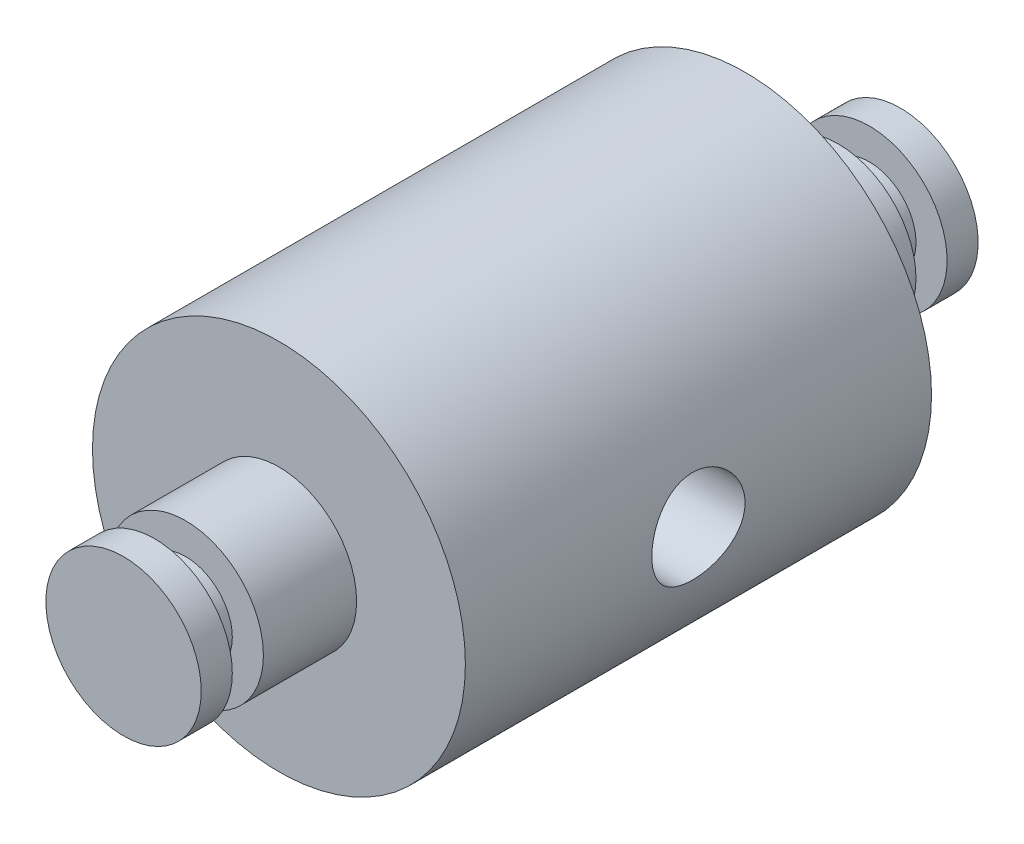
from build123d import *

# Parameters (mm, degrees)
ESQUISSE1_R             = 6
EXTRUSION1_DEPTH        = 15
ESQUISSE2_R             = 2.5
EXTRUSION2_DEPTH        = 3
ESQUISSE3_R             = 1.5
EXTRUSION3_DEPTH        = 1
ESQUISSE4_R             = 2.5
EXTRUSION4_DEPTH        = 1
EXTRUSION5_START        = 3
ESQUISSE5_R             = 2.5
EXTRUSION5_DEPTH        = 3
EXTRUSION6_START        = 1
ESQUISSE6_R             = 1.5
EXTRUSION6_DEPTH        = 1
EXTRUSION7_START        = 1
ESQUISSE7_R             = 2.5
EXTRUSION7_DEPTH        = 1
ESQUISSE8_R             = 4
ENL_V_MAT_EXTRU_1_DEPTH = 13
ESQUISSE9_R             = 1.5
ENL_V_MAT_EXTRU_2_DEPTH = 13


with BuildPart() as part:
    # Esquisse1 → Extrusion1 (new body)
    with BuildSketch(Plane.XY):
        Circle(ESQUISSE1_R)
    extrude(amount=-EXTRUSION1_DEPTH)

    # Esquisse2 → Extrusion2 (add)
    with BuildSketch(Plane.XY):
        Circle(ESQUISSE2_R)
    extrude(amount=EXTRUSION2_DEPTH)

    # Esquisse3 → Extrusion3 (add)
    with BuildSketch(Plane.XY.offset(3)):
        Circle(ESQUISSE3_R)
    extrude(amount=EXTRUSION3_DEPTH)

    # Esquisse4 → Extrusion4 (add)
    with BuildSketch(Plane.XY.offset(4)):
        Circle(ESQUISSE4_R)
    extrude(amount=EXTRUSION4_DEPTH)

    # Esquisse5 → Extrusion5 (add)
    with BuildSketch(Plane(origin=(0, 0, -15), x_dir=(-1, 0, 0), z_dir=(0, 0, -1)).offset(EXTRUSION5_START)):
        with Locations(Location((0, 0, 0), (0, 0, 180))):
            Circle(ESQUISSE5_R)
    extrude(amount=-EXTRUSION5_DEPTH)

    # Esquisse6 → Extrusion6 (add)
    with BuildSketch(Plane(origin=(0, 0, -18), x_dir=(-1, 0, 0), z_dir=(0, 0, -1)).offset(EXTRUSION6_START)):
        with Locations(Location((0, 0, 0), (0, 0, 180))):
            Circle(ESQUISSE6_R)
    extrude(amount=-EXTRUSION6_DEPTH)

    # Esquisse7 → Extrusion7 (add)
    with BuildSketch(Plane(origin=(0, 0, -19), x_dir=(-1, 0, 0), z_dir=(0, 0, -1)).offset(EXTRUSION7_START)):
        with Locations(Location((0, 0, 0), (0, 0, 180))):
            Circle(ESQUISSE7_R)
    extrude(amount=-EXTRUSION7_DEPTH)

    # Esquisse8 → Enl_v. mat.-Extru.1 (cut)
    with BuildSketch(Plane(origin=(0, 0, 0), x_dir=(0, 0, -1), z_dir=(1, 0, 0))):
        with Locations((7.5, 0)):
            Circle(ESQUISSE8_R)
    extrude(amount=-ENL_V_MAT_EXTRU_1_DEPTH, mode=Mode.SUBTRACT)

    # Esquisse9 → Enl_v. mat.-Extru.2 (cut)
    with BuildSketch(Plane.ZY):
        with Locations((-7.5, 0)):
            Circle(ESQUISSE9_R)
    extrude(amount=-ENL_V_MAT_EXTRU_2_DEPTH, mode=Mode.SUBTRACT)


solid = part.part
